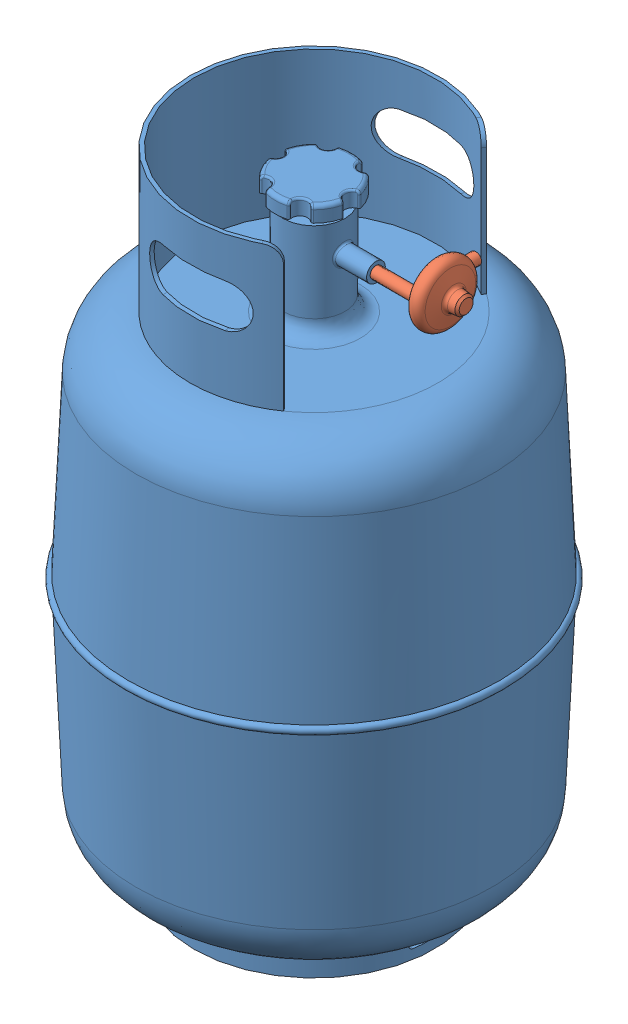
SolidWorks assembly Tank_&_Regulator_&.SLDASM, configuration Default (file format 4400). Lengths in mm.
Overall size (311.15 521.42 311.15).
2 component instances, 2 part files, 3 mates.
Components (placement in the parent):
- tank_20lb_propane_&-1: tank_20lb_propane_&.sldprt [Default] at origin size (311.15 521.42 311.15)
- regulator_&-1: regulator_&.sldprt [Default] at (86.675 431.8 -12.7) x (0 -1 0) z (0 0 1) size (50.8 73.97 63.5)
Mates (geometry in assembly coordinates):
- Concentric1: concentric anti-aligned: cylinder of tank_20lb_propane_&-1 through (50.8 431.8 0) axis (-1 0 0) radius 7.7; cylinder of regulator_&-1 through (38.1 431.8 0) axis (1 0 0) radius 3.9688
- Coincident1: coincident anti-aligned: plane of tank_20lb_propane_&-1 through (50.8 431.8 0) normal (1 0 0); circle of regulator_&-1
- Parallel1: parallel anti-aligned: plane of regulator_&-1; plane of assembly through (0 0 0) normal (0 1 0)
